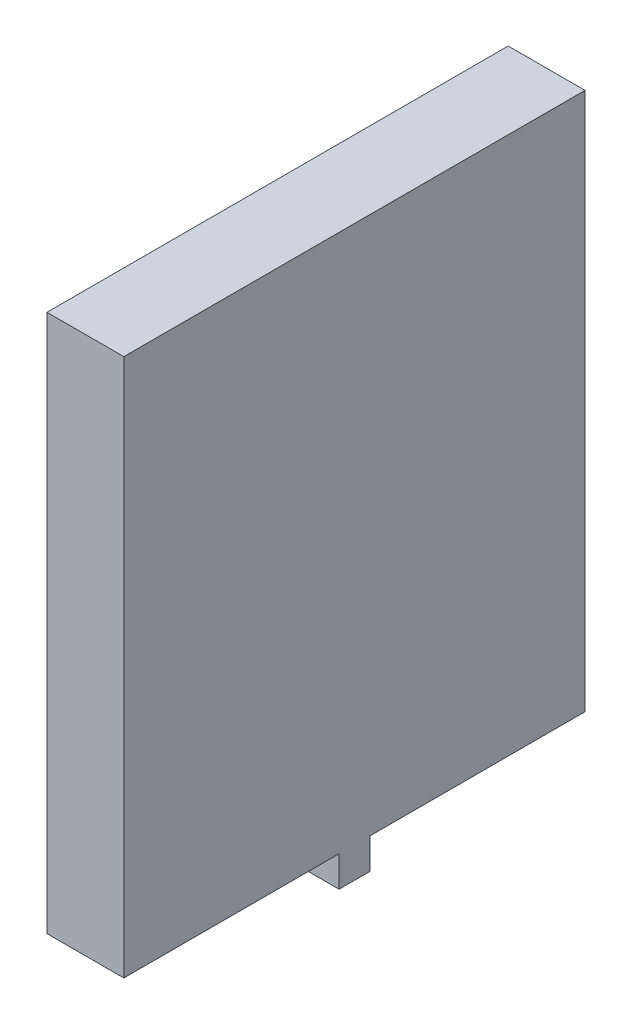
ISO-10303-21;
HEADER;
FILE_DESCRIPTION(('STEP AP214'),'2;1');
FILE_NAME('part.step','',(''),(''),'','','');
FILE_SCHEMA(('AUTOMOTIVE_DESIGN { 1 0 10303 214 1 1 1 1 }'));
ENDSEC;
DATA;
#1=APPLICATION_CONTEXT('core data for automotive mechanical design processes');
#2=APPLICATION_PROTOCOL_DEFINITION('international standard','automotive_design',2000,#1);
#3=PRODUCT_CONTEXT('',#1,'mechanical');
#4=PRODUCT('Part','Part','',(#3));
#5=PRODUCT_RELATED_PRODUCT_CATEGORY('part','',(#4));
#6=PRODUCT_DEFINITION_FORMATION('','',#4);
#7=PRODUCT_DEFINITION_CONTEXT('part definition',#1,'design');
#8=PRODUCT_DEFINITION('design','',#6,#7);
#9=PRODUCT_DEFINITION_SHAPE('','',#8);
#10=(LENGTH_UNIT() NAMED_UNIT(*) SI_UNIT(.MILLI.,.METRE.));
#11=(NAMED_UNIT(*) PLANE_ANGLE_UNIT() SI_UNIT($,.RADIAN.));
#12=(NAMED_UNIT(*) SI_UNIT($,.STERADIAN.) SOLID_ANGLE_UNIT());
#13=UNCERTAINTY_MEASURE_WITH_UNIT(LENGTH_MEASURE(1.E-05),#10,'distance_accuracy_value','');
#14=(GEOMETRIC_REPRESENTATION_CONTEXT(3) GLOBAL_UNCERTAINTY_ASSIGNED_CONTEXT((#13)) GLOBAL_UNIT_ASSIGNED_CONTEXT((#10,
#11,#12)) REPRESENTATION_CONTEXT('',''));
#15=CARTESIAN_POINT('',(0.,0.,0.));
#16=DIRECTION('',(0.,0.,1.));
#17=DIRECTION('',(1.,0.,0.));
#18=AXIS2_PLACEMENT_3D('',#15,#16,#17);
#19=CARTESIAN_POINT('',(10.,-35.,30.));
#20=DIRECTION('',(0.,1.,0.));
#21=DIRECTION('',(0.,0.,1.));
#22=AXIS2_PLACEMENT_3D('',#19,#20,#21);
#23=PLANE('',#22);
#24=CARTESIAN_POINT('',(-14.,-35.,0.));
#25=DIRECTION('',(0.,1.,0.));
#26=DIRECTION('',(0.,0.,1.));
#27=AXIS2_PLACEMENT_3D('',#24,#25,#26);
#28=CIRCLE('',#27,3.5);
#29=CARTESIAN_POINT('',(-14.,-35.,3.5));
#30=VERTEX_POINT('',#29);
#31=EDGE_CURVE('E161',#30,#30,#28,.T.);
#32=ORIENTED_EDGE('',*,*,#31,.T.);
#33=EDGE_LOOP('',(#32));
#34=FACE_BOUND('',#33,.T.);
#35=DIRECTION('',(1.,0.,0.));
#36=VECTOR('',#35,1.);
#37=CARTESIAN_POINT('',(0.,-35.,-2.));
#38=LINE('',#37,#36);
#39=CARTESIAN_POINT('',(0.,-35.,-2.));
#40=VERTEX_POINT('',#39);
#41=CARTESIAN_POINT('',(10.,-35.,-2.));
#42=VERTEX_POINT('',#41);
#43=EDGE_CURVE('E55',#40,#42,#38,.T.);
#44=ORIENTED_EDGE('',*,*,#43,.F.);
#45=DIRECTION('',(0.,0.,-1.));
#46=VECTOR('',#45,1.);
#47=CARTESIAN_POINT('',(0.,-35.,-2.));
#48=LINE('',#47,#46);
#49=CARTESIAN_POINT('',(0.,-35.,2.));
#50=VERTEX_POINT('',#49);
#51=EDGE_CURVE('E312',#50,#40,#48,.T.);
#52=ORIENTED_EDGE('',*,*,#51,.F.);
#53=DIRECTION('',(-1.,0.,0.));
#54=VECTOR('',#53,1.);
#55=CARTESIAN_POINT('',(0.,-35.,2.));
#56=LINE('',#55,#54);
#57=CARTESIAN_POINT('',(10.,-35.,2.));
#58=VERTEX_POINT('',#57);
#59=EDGE_CURVE('E315',#58,#50,#56,.T.);
#60=ORIENTED_EDGE('',*,*,#59,.F.);
#61=DIRECTION('',(0.,0.,-1.));
#62=VECTOR('',#61,1.);
#63=CARTESIAN_POINT('',(10.,-35.,30.));
#64=LINE('',#63,#62);
#65=CARTESIAN_POINT('',(10.,-35.,30.));
#66=VERTEX_POINT('',#65);
#67=EDGE_CURVE('E154',#66,#58,#64,.T.);
#68=ORIENTED_EDGE('',*,*,#67,.F.);
#69=DIRECTION('',(-1.,0.,0.));
#70=VECTOR('',#69,1.);
#71=CARTESIAN_POINT('',(10.,-35.,30.));
#72=LINE('',#71,#70);
#73=CARTESIAN_POINT('',(0.,-35.,30.));
#74=VERTEX_POINT('',#73);
#75=EDGE_CURVE('E241',#66,#74,#72,.T.);
#76=ORIENTED_EDGE('',*,*,#75,.T.);
#77=DIRECTION('',(0.,0.,-1.));
#78=VECTOR('',#77,1.);
#79=CARTESIAN_POINT('',(0.,-35.,30.));
#80=LINE('',#79,#78);
#81=CARTESIAN_POINT('',(0.,-35.,7.5));
#82=VERTEX_POINT('',#81);
#83=EDGE_CURVE('E216',#74,#82,#80,.T.);
#84=ORIENTED_EDGE('',*,*,#83,.T.);
#85=DIRECTION('',(1.,0.,0.));
#86=VECTOR('',#85,1.);
#87=CARTESIAN_POINT('',(-20.,-35.,7.5));
#88=LINE('',#87,#86);
#89=CARTESIAN_POINT('',(-20.,-35.,7.5));
#90=VERTEX_POINT('',#89);
#91=EDGE_CURVE('E185',#90,#82,#88,.T.);
#92=ORIENTED_EDGE('',*,*,#91,.F.);
#93=DIRECTION('',(0.,0.,1.));
#94=VECTOR('',#93,1.);
#95=CARTESIAN_POINT('',(-20.,-35.,-7.5));
#96=LINE('',#95,#94);
#97=CARTESIAN_POINT('',(-20.,-35.,-7.5));
#98=VERTEX_POINT('',#97);
#99=EDGE_CURVE('E182',#98,#90,#96,.T.);
#100=ORIENTED_EDGE('',*,*,#99,.F.);
#101=DIRECTION('',(1.,0.,0.));
#102=VECTOR('',#101,1.);
#103=CARTESIAN_POINT('',(-20.,-35.,-7.5));
#104=LINE('',#103,#102);
#105=CARTESIAN_POINT('',(0.,-35.,-7.5));
#106=VERTEX_POINT('',#105);
#107=EDGE_CURVE('E199',#98,#106,#104,.T.);
#108=ORIENTED_EDGE('',*,*,#107,.T.);
#109=CARTESIAN_POINT('',(0.,-35.,-30.));
#110=VERTEX_POINT('',#109);
#111=EDGE_CURVE('E234',#106,#110,#80,.T.);
#112=ORIENTED_EDGE('',*,*,#111,.T.);
#113=DIRECTION('',(-1.,0.,0.));
#114=VECTOR('',#113,1.);
#115=CARTESIAN_POINT('',(10.,-35.,-30.));
#116=LINE('',#115,#114);
#117=CARTESIAN_POINT('',(10.,-35.,-30.));
#118=VERTEX_POINT('',#117);
#119=EDGE_CURVE('E224',#118,#110,#116,.T.);
#120=ORIENTED_EDGE('',*,*,#119,.F.);
#121=EDGE_CURVE('E60',#42,#118,#64,.T.);
#122=ORIENTED_EDGE('',*,*,#121,.F.);
#123=EDGE_LOOP('',(#44,#52,#60,#68,#76,#84,#92,#100,#108,#112,#120,#122));
#124=FACE_BOUND('',#123,.T.);
#125=ADVANCED_FACE('F39',(#34,#124),#23,.F.);
#126=CARTESIAN_POINT('',(10.,-35.,-30.));
#127=DIRECTION('',(0.,0.,1.));
#128=DIRECTION('',(1.,0.,0.));
#129=AXIS2_PLACEMENT_3D('',#126,#127,#128);
#130=PLANE('',#129);
#131=DIRECTION('',(0.,1.,0.));
#132=VECTOR('',#131,1.);
#133=CARTESIAN_POINT('',(0.,-35.,-30.));
#134=LINE('',#133,#132);
#135=CARTESIAN_POINT('',(0.,35.,-30.));
#136=VERTEX_POINT('',#135);
#137=EDGE_CURVE('E211',#110,#136,#134,.T.);
#138=ORIENTED_EDGE('',*,*,#137,.T.);
#139=DIRECTION('',(-1.,0.,0.));
#140=VECTOR('',#139,1.);
#141=CARTESIAN_POINT('',(10.,35.,-30.));
#142=LINE('',#141,#140);
#143=CARTESIAN_POINT('',(10.,35.,-30.));
#144=VERTEX_POINT('',#143);
#145=EDGE_CURVE('E11',#144,#136,#142,.T.);
#146=ORIENTED_EDGE('',*,*,#145,.F.);
#147=DIRECTION('',(0.,1.,0.));
#148=VECTOR('',#147,1.);
#149=CARTESIAN_POINT('',(10.,-35.,-30.));
#150=LINE('',#149,#148);
#151=EDGE_CURVE('E212',#118,#144,#150,.T.);
#152=ORIENTED_EDGE('',*,*,#151,.F.);
#153=ORIENTED_EDGE('',*,*,#119,.T.);
#154=EDGE_LOOP('',(#138,#146,#152,#153));
#155=FACE_BOUND('',#154,.T.);
#156=ADVANCED_FACE('F41',(#155),#130,.F.);
#157=CARTESIAN_POINT('',(10.,35.,30.));
#158=DIRECTION('',(0.,-1.,0.));
#159=DIRECTION('',(0.,0.,-1.));
#160=AXIS2_PLACEMENT_3D('',#157,#158,#159);
#161=PLANE('',#160);
#162=DIRECTION('',(0.,0.,1.));
#163=VECTOR('',#162,1.);
#164=CARTESIAN_POINT('',(0.,35.,30.));
#165=LINE('',#164,#163);
#166=CARTESIAN_POINT('',(0.,35.,30.));
#167=VERTEX_POINT('',#166);
#168=EDGE_CURVE('E228',#136,#167,#165,.T.);
#169=ORIENTED_EDGE('',*,*,#168,.T.);
#170=DIRECTION('',(-1.,0.,0.));
#171=VECTOR('',#170,1.);
#172=CARTESIAN_POINT('',(10.,35.,30.));
#173=LINE('',#172,#171);
#174=CARTESIAN_POINT('',(10.,35.,30.));
#175=VERTEX_POINT('',#174);
#176=EDGE_CURVE('E48',#175,#167,#173,.T.);
#177=ORIENTED_EDGE('',*,*,#176,.F.);
#178=DIRECTION('',(0.,0.,1.));
#179=VECTOR('',#178,1.);
#180=CARTESIAN_POINT('',(10.,35.,30.));
#181=LINE('',#180,#179);
#182=EDGE_CURVE('E215',#144,#175,#181,.T.);
#183=ORIENTED_EDGE('',*,*,#182,.F.);
#184=ORIENTED_EDGE('',*,*,#145,.T.);
#185=EDGE_LOOP('',(#169,#177,#183,#184));
#186=FACE_BOUND('',#185,.T.);
#187=ADVANCED_FACE('F288',(#186),#161,.F.);
#188=CARTESIAN_POINT('',(10.,-35.,30.));
#189=DIRECTION('',(0.,0.,-1.));
#190=DIRECTION('',(-1.,0.,0.));
#191=AXIS2_PLACEMENT_3D('',#188,#189,#190);
#192=PLANE('',#191);
#193=DIRECTION('',(0.,-1.,0.));
#194=VECTOR('',#193,1.);
#195=CARTESIAN_POINT('',(0.,-35.,30.));
#196=LINE('',#195,#194);
#197=EDGE_CURVE('E231',#167,#74,#196,.T.);
#198=ORIENTED_EDGE('',*,*,#197,.T.);
#199=ORIENTED_EDGE('',*,*,#75,.F.);
#200=DIRECTION('',(0.,-1.,0.));
#201=VECTOR('',#200,1.);
#202=CARTESIAN_POINT('',(10.,-35.,30.));
#203=LINE('',#202,#201);
#204=EDGE_CURVE('E219',#175,#66,#203,.T.);
#205=ORIENTED_EDGE('',*,*,#204,.F.);
#206=ORIENTED_EDGE('',*,*,#176,.T.);
#207=EDGE_LOOP('',(#198,#199,#205,#206));
#208=FACE_BOUND('',#207,.T.);
#209=ADVANCED_FACE('F250',(#208),#192,.F.);
#210=CARTESIAN_POINT('',(10.,0.,0.));
#211=DIRECTION('',(-1.,0.,0.));
#212=DIRECTION('',(0.,0.,1.));
#213=AXIS2_PLACEMENT_3D('',#210,#211,#212);
#214=PLANE('',#213);
#215=ORIENTED_EDGE('',*,*,#151,.T.);
#216=ORIENTED_EDGE('',*,*,#182,.T.);
#217=ORIENTED_EDGE('',*,*,#204,.T.);
#218=ORIENTED_EDGE('',*,*,#67,.T.);
#219=DIRECTION('',(0.,1.,0.));
#220=VECTOR('',#219,1.);
#221=CARTESIAN_POINT('',(9.99999999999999,-39.,2.));
#222=LINE('',#221,#220);
#223=CARTESIAN_POINT('',(9.99999999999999,-39.,2.));
#224=VERTEX_POINT('',#223);
#225=EDGE_CURVE('E132',#224,#58,#222,.T.);
#226=ORIENTED_EDGE('',*,*,#225,.F.);
#227=DIRECTION('',(0.,0.,1.));
#228=VECTOR('',#227,1.);
#229=CARTESIAN_POINT('',(9.99999999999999,-39.,-2.));
#230=LINE('',#229,#228);
#231=CARTESIAN_POINT('',(9.99999999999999,-39.,-2.));
#232=VERTEX_POINT('',#231);
#233=EDGE_CURVE('E139',#232,#224,#230,.T.);
#234=ORIENTED_EDGE('',*,*,#233,.F.);
#235=DIRECTION('',(0.,1.,0.));
#236=VECTOR('',#235,1.);
#237=CARTESIAN_POINT('',(9.99999999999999,-39.,-2.));
#238=LINE('',#237,#236);
#239=EDGE_CURVE('E299',#232,#42,#238,.T.);
#240=ORIENTED_EDGE('',*,*,#239,.T.);
#241=ORIENTED_EDGE('',*,*,#121,.T.);
#242=EDGE_LOOP('',(#215,#216,#217,#218,#226,#234,#240,#241));
#243=FACE_BOUND('',#242,.T.);
#244=ADVANCED_FACE('F152',(#243),#214,.F.);
#245=CARTESIAN_POINT('',(0.,0.,0.));
#246=DIRECTION('',(-1.,0.,0.));
#247=DIRECTION('',(0.,0.,1.));
#248=AXIS2_PLACEMENT_3D('',#245,#246,#247);
#249=PLANE('',#248);
#250=DIRECTION('',(0.,1.,0.));
#251=VECTOR('',#250,1.);
#252=CARTESIAN_POINT('',(0.,-25.,7.5));
#253=LINE('',#252,#251);
#254=CARTESIAN_POINT('',(0.,-25.,7.5));
#255=VERTEX_POINT('',#254);
#256=EDGE_CURVE('E170',#82,#255,#253,.T.);
#257=ORIENTED_EDGE('',*,*,#256,.F.);
#258=ORIENTED_EDGE('',*,*,#83,.F.);
#259=ORIENTED_EDGE('',*,*,#197,.F.);
#260=ORIENTED_EDGE('',*,*,#168,.F.);
#261=ORIENTED_EDGE('',*,*,#137,.F.);
#262=ORIENTED_EDGE('',*,*,#111,.F.);
#263=DIRECTION('',(0.,-1.,0.));
#264=VECTOR('',#263,1.);
#265=CARTESIAN_POINT('',(0.,-25.,-7.5));
#266=LINE('',#265,#264);
#267=CARTESIAN_POINT('',(0.,-25.,-7.5));
#268=VERTEX_POINT('',#267);
#269=EDGE_CURVE('E176',#268,#106,#266,.T.);
#270=ORIENTED_EDGE('',*,*,#269,.F.);
#271=DIRECTION('',(0.,0.,-1.));
#272=VECTOR('',#271,1.);
#273=CARTESIAN_POINT('',(0.,-25.,-7.5));
#274=LINE('',#273,#272);
#275=EDGE_CURVE('E189',#255,#268,#274,.T.);
#276=ORIENTED_EDGE('',*,*,#275,.F.);
#277=EDGE_LOOP('',(#257,#258,#259,#260,#261,#262,#270,#276));
#278=FACE_BOUND('',#277,.T.);
#279=ADVANCED_FACE('F255',(#278),#249,.T.);
#280=CARTESIAN_POINT('',(-20.,-25.,7.5));
#281=DIRECTION('',(0.,0.,-1.));
#282=DIRECTION('',(0.,1.,0.));
#283=AXIS2_PLACEMENT_3D('',#280,#281,#282);
#284=PLANE('',#283);
#285=ORIENTED_EDGE('',*,*,#256,.T.);
#286=DIRECTION('',(1.,0.,0.));
#287=VECTOR('',#286,1.);
#288=CARTESIAN_POINT('',(-20.,-25.,7.5));
#289=LINE('',#288,#287);
#290=CARTESIAN_POINT('',(-20.,-25.,7.5));
#291=VERTEX_POINT('',#290);
#292=EDGE_CURVE('E207',#291,#255,#289,.T.);
#293=ORIENTED_EDGE('',*,*,#292,.F.);
#294=DIRECTION('',(0.,1.,0.));
#295=VECTOR('',#294,1.);
#296=CARTESIAN_POINT('',(-20.,-25.,7.5));
#297=LINE('',#296,#295);
#298=EDGE_CURVE('E171',#90,#291,#297,.T.);
#299=ORIENTED_EDGE('',*,*,#298,.F.);
#300=ORIENTED_EDGE('',*,*,#91,.T.);
#301=EDGE_LOOP('',(#285,#293,#299,#300));
#302=FACE_BOUND('',#301,.T.);
#303=ADVANCED_FACE('F261',(#302),#284,.F.);
#304=CARTESIAN_POINT('',(-20.,-25.,-7.5));
#305=DIRECTION('',(0.,-1.,0.));
#306=DIRECTION('',(0.,0.,-1.));
#307=AXIS2_PLACEMENT_3D('',#304,#305,#306);
#308=PLANE('',#307);
#309=CARTESIAN_POINT('',(-14.,-25.,0.));
#310=DIRECTION('',(0.,1.,0.));
#311=DIRECTION('',(0.,0.,1.));
#312=AXIS2_PLACEMENT_3D('',#309,#310,#311);
#313=CIRCLE('',#312,3.5);
#314=CARTESIAN_POINT('',(-14.,-25.,3.5));
#315=VERTEX_POINT('',#314);
#316=EDGE_CURVE('E156',#315,#315,#313,.T.);
#317=ORIENTED_EDGE('',*,*,#316,.F.);
#318=EDGE_LOOP('',(#317));
#319=FACE_BOUND('',#318,.T.);
#320=ORIENTED_EDGE('',*,*,#275,.T.);
#321=DIRECTION('',(1.,0.,0.));
#322=VECTOR('',#321,1.);
#323=CARTESIAN_POINT('',(-20.,-25.,-7.5));
#324=LINE('',#323,#322);
#325=CARTESIAN_POINT('',(-20.,-25.,-7.5));
#326=VERTEX_POINT('',#325);
#327=EDGE_CURVE('E203',#326,#268,#324,.T.);
#328=ORIENTED_EDGE('',*,*,#327,.F.);
#329=DIRECTION('',(0.,0.,-1.));
#330=VECTOR('',#329,1.);
#331=CARTESIAN_POINT('',(-20.,-25.,-7.5));
#332=LINE('',#331,#330);
#333=EDGE_CURVE('E175',#291,#326,#332,.T.);
#334=ORIENTED_EDGE('',*,*,#333,.F.);
#335=ORIENTED_EDGE('',*,*,#292,.T.);
#336=EDGE_LOOP('',(#320,#328,#334,#335));
#337=FACE_BOUND('',#336,.T.);
#338=ADVANCED_FACE('F271',(#319,#337),#308,.F.);
#339=CARTESIAN_POINT('',(-20.,-25.,-7.5));
#340=DIRECTION('',(0.,0.,1.));
#341=DIRECTION('',(0.,-1.,0.));
#342=AXIS2_PLACEMENT_3D('',#339,#340,#341);
#343=PLANE('',#342);
#344=ORIENTED_EDGE('',*,*,#269,.T.);
#345=ORIENTED_EDGE('',*,*,#107,.F.);
#346=DIRECTION('',(0.,-1.,0.));
#347=VECTOR('',#346,1.);
#348=CARTESIAN_POINT('',(-20.,-25.,-7.5));
#349=LINE('',#348,#347);
#350=EDGE_CURVE('E179',#326,#98,#349,.T.);
#351=ORIENTED_EDGE('',*,*,#350,.F.);
#352=ORIENTED_EDGE('',*,*,#327,.T.);
#353=EDGE_LOOP('',(#344,#345,#351,#352));
#354=FACE_BOUND('',#353,.T.);
#355=ADVANCED_FACE('F269',(#354),#343,.F.);
#356=CARTESIAN_POINT('',(-20.,0.,0.));
#357=DIRECTION('',(-1.,0.,0.));
#358=DIRECTION('',(0.,0.,1.));
#359=AXIS2_PLACEMENT_3D('',#356,#357,#358);
#360=PLANE('',#359);
#361=ORIENTED_EDGE('',*,*,#298,.T.);
#362=ORIENTED_EDGE('',*,*,#333,.T.);
#363=ORIENTED_EDGE('',*,*,#350,.T.);
#364=ORIENTED_EDGE('',*,*,#99,.T.);
#365=EDGE_LOOP('',(#361,#362,#363,#364));
#366=FACE_BOUND('',#365,.T.);
#367=ADVANCED_FACE('F264',(#366),#360,.T.);
#368=CARTESIAN_POINT('',(-14.,-55.,0.));
#369=DIRECTION('',(0.,1.,0.));
#370=DIRECTION('',(0.,0.,1.));
#371=AXIS2_PLACEMENT_3D('',#368,#369,#370);
#372=CYLINDRICAL_SURFACE('',#371,3.5);
#373=ORIENTED_EDGE('',*,*,#316,.T.);
#374=EDGE_LOOP('',(#373));
#375=FACE_BOUND('',#374,.T.);
#376=ORIENTED_EDGE('',*,*,#31,.F.);
#377=EDGE_LOOP('',(#376));
#378=FACE_BOUND('',#377,.T.);
#379=ADVANCED_FACE('F334',(#375,#378),#372,.F.);
#380=CARTESIAN_POINT('',(0.,-39.,2.));
#381=DIRECTION('',(0.,0.,-1.));
#382=DIRECTION('',(-1.,0.,0.));
#383=AXIS2_PLACEMENT_3D('',#380,#381,#382);
#384=PLANE('',#383);
#385=ORIENTED_EDGE('',*,*,#59,.T.);
#386=DIRECTION('',(0.,1.,0.));
#387=VECTOR('',#386,1.);
#388=CARTESIAN_POINT('',(0.,-39.,2.));
#389=LINE('',#388,#387);
#390=CARTESIAN_POINT('',(0.,-39.,2.));
#391=VERTEX_POINT('',#390);
#392=EDGE_CURVE('E134',#391,#50,#389,.T.);
#393=ORIENTED_EDGE('',*,*,#392,.F.);
#394=DIRECTION('',(-1.,0.,0.));
#395=VECTOR('',#394,1.);
#396=CARTESIAN_POINT('',(0.,-39.,2.));
#397=LINE('',#396,#395);
#398=EDGE_CURVE('E127',#224,#391,#397,.T.);
#399=ORIENTED_EDGE('',*,*,#398,.F.);
#400=ORIENTED_EDGE('',*,*,#225,.T.);
#401=EDGE_LOOP('',(#385,#393,#399,#400));
#402=FACE_BOUND('',#401,.T.);
#403=ADVANCED_FACE('F130',(#402),#384,.F.);
#404=CARTESIAN_POINT('',(0.,-39.,-2.));
#405=DIRECTION('',(1.,0.,0.));
#406=DIRECTION('',(0.,0.,-1.));
#407=AXIS2_PLACEMENT_3D('',#404,#405,#406);
#408=PLANE('',#407);
#409=ORIENTED_EDGE('',*,*,#51,.T.);
#410=DIRECTION('',(0.,1.,0.));
#411=VECTOR('',#410,1.);
#412=CARTESIAN_POINT('',(0.,-39.,-2.));
#413=LINE('',#412,#411);
#414=CARTESIAN_POINT('',(0.,-39.,-2.));
#415=VERTEX_POINT('',#414);
#416=EDGE_CURVE('E163',#415,#40,#413,.T.);
#417=ORIENTED_EDGE('',*,*,#416,.F.);
#418=DIRECTION('',(0.,0.,-1.));
#419=VECTOR('',#418,1.);
#420=CARTESIAN_POINT('',(0.,-39.,-2.));
#421=LINE('',#420,#419);
#422=EDGE_CURVE('E138',#391,#415,#421,.T.);
#423=ORIENTED_EDGE('',*,*,#422,.F.);
#424=ORIENTED_EDGE('',*,*,#392,.T.);
#425=EDGE_LOOP('',(#409,#417,#423,#424));
#426=FACE_BOUND('',#425,.T.);
#427=ADVANCED_FACE('F321',(#426),#408,.F.);
#428=CARTESIAN_POINT('',(0.,-39.,-2.));
#429=DIRECTION('',(0.,0.,1.));
#430=DIRECTION('',(1.,0.,0.));
#431=AXIS2_PLACEMENT_3D('',#428,#429,#430);
#432=PLANE('',#431);
#433=ORIENTED_EDGE('',*,*,#43,.T.);
#434=ORIENTED_EDGE('',*,*,#239,.F.);
#435=DIRECTION('',(1.,0.,0.));
#436=VECTOR('',#435,1.);
#437=CARTESIAN_POINT('',(0.,-39.,-2.));
#438=LINE('',#437,#436);
#439=EDGE_CURVE('E144',#415,#232,#438,.T.);
#440=ORIENTED_EDGE('',*,*,#439,.F.);
#441=ORIENTED_EDGE('',*,*,#416,.T.);
#442=EDGE_LOOP('',(#433,#434,#440,#441));
#443=FACE_BOUND('',#442,.T.);
#444=ADVANCED_FACE('F322',(#443),#432,.F.);
#445=CARTESIAN_POINT('',(0.,-39.,0.));
#446=DIRECTION('',(0.,1.,0.));
#447=DIRECTION('',(0.,0.,1.));
#448=AXIS2_PLACEMENT_3D('',#445,#446,#447);
#449=PLANE('',#448);
#450=ORIENTED_EDGE('',*,*,#233,.T.);
#451=ORIENTED_EDGE('',*,*,#398,.T.);
#452=ORIENTED_EDGE('',*,*,#422,.T.);
#453=ORIENTED_EDGE('',*,*,#439,.T.);
#454=EDGE_LOOP('',(#450,#451,#452,#453));
#455=FACE_BOUND('',#454,.T.);
#456=ADVANCED_FACE('F142',(#455),#449,.F.);
#457=CLOSED_SHELL('',(#125,#156,#187,#209,#244,#279,#303,#338,#355,#367,#379,#403,#427,#444,#456));
#458=MANIFOLD_SOLID_BREP('B2',#457);
#459=ADVANCED_BREP_SHAPE_REPRESENTATION('',(#18,#458),#14);
#460=SHAPE_DEFINITION_REPRESENTATION(#9,#459);
ENDSEC;
END-ISO-10303-21;
